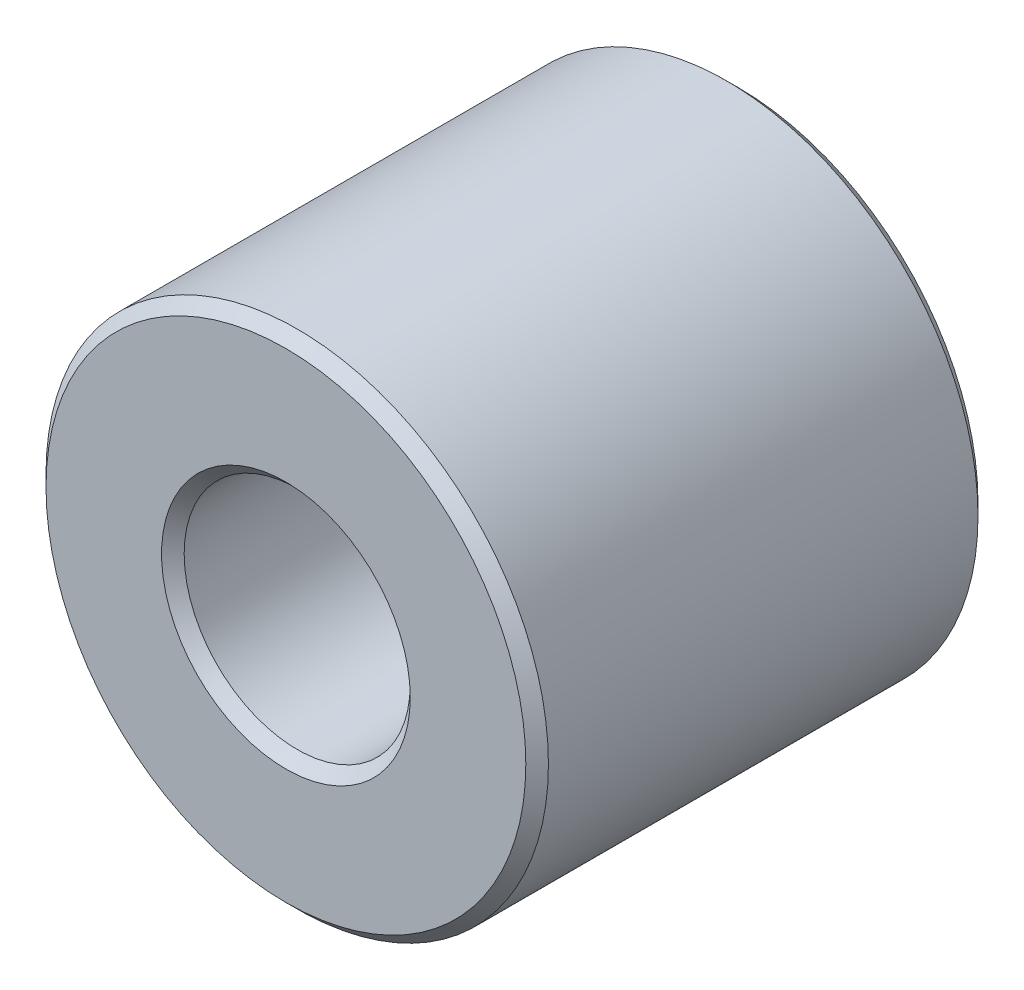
ISO-10303-21;
HEADER;
FILE_DESCRIPTION(('STEP AP214'),'2;1');
FILE_NAME('part.step','',(''),(''),'','','');
FILE_SCHEMA(('AUTOMOTIVE_DESIGN { 1 0 10303 214 1 1 1 1 }'));
ENDSEC;
DATA;
#1=APPLICATION_CONTEXT('core data for automotive mechanical design processes');
#2=APPLICATION_PROTOCOL_DEFINITION('international standard','automotive_design',2000,#1);
#3=PRODUCT_CONTEXT('',#1,'mechanical');
#4=PRODUCT('Part','Part','',(#3));
#5=PRODUCT_RELATED_PRODUCT_CATEGORY('part','',(#4));
#6=PRODUCT_DEFINITION_FORMATION('','',#4);
#7=PRODUCT_DEFINITION_CONTEXT('part definition',#1,'design');
#8=PRODUCT_DEFINITION('design','',#6,#7);
#9=PRODUCT_DEFINITION_SHAPE('','',#8);
#10=(LENGTH_UNIT() NAMED_UNIT(*) SI_UNIT(.MILLI.,.METRE.));
#11=(NAMED_UNIT(*) PLANE_ANGLE_UNIT() SI_UNIT($,.RADIAN.));
#12=(NAMED_UNIT(*) SI_UNIT($,.STERADIAN.) SOLID_ANGLE_UNIT());
#13=UNCERTAINTY_MEASURE_WITH_UNIT(LENGTH_MEASURE(1.E-05),#10,'distance_accuracy_value','');
#14=(GEOMETRIC_REPRESENTATION_CONTEXT(3) GLOBAL_UNCERTAINTY_ASSIGNED_CONTEXT((#13)) GLOBAL_UNIT_ASSIGNED_CONTEXT((#10,
#11,#12)) REPRESENTATION_CONTEXT('',''));
#15=CARTESIAN_POINT('',(0.,0.,0.));
#16=DIRECTION('',(0.,0.,1.));
#17=DIRECTION('',(1.,0.,0.));
#18=AXIS2_PLACEMENT_3D('',#15,#16,#17);
#19=CARTESIAN_POINT('',(0.,0.,18.));
#20=DIRECTION('',(0.,0.,1.));
#21=DIRECTION('',(1.,0.,0.));
#22=AXIS2_PLACEMENT_3D('',#19,#20,#21);
#23=PLANE('',#22);
#24=CARTESIAN_POINT('',(0.,0.,18.));
#25=DIRECTION('',(0.,0.,1.));
#26=DIRECTION('',(1.,0.,0.));
#27=AXIS2_PLACEMENT_3D('',#24,#25,#26);
#28=CIRCLE('',#27,9.90000000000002);
#29=CARTESIAN_POINT('',(9.90000000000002,0.,18.));
#30=VERTEX_POINT('',#29);
#31=EDGE_CURVE('E10',#30,#30,#28,.F.);
#32=ORIENTED_EDGE('',*,*,#31,.T.);
#33=EDGE_LOOP('',(#32));
#34=FACE_BOUND('',#33,.T.);
#35=CARTESIAN_POINT('',(0.,0.,18.));
#36=DIRECTION('',(0.,0.,1.));
#37=DIRECTION('',(1.,0.,0.));
#38=AXIS2_PLACEMENT_3D('',#35,#36,#37);
#39=CIRCLE('',#38,19.1);
#40=CARTESIAN_POINT('',(19.1,0.,18.));
#41=VERTEX_POINT('',#40);
#42=EDGE_CURVE('E45',#41,#41,#39,.T.);
#43=ORIENTED_EDGE('',*,*,#42,.T.);
#44=EDGE_LOOP('',(#43));
#45=FACE_BOUND('',#44,.T.);
#46=ADVANCED_FACE('F37',(#34,#45),#23,.T.);
#47=CARTESIAN_POINT('',(0.,0.,-18.));
#48=DIRECTION('',(0.,0.,1.));
#49=DIRECTION('',(1.,0.,0.));
#50=AXIS2_PLACEMENT_3D('',#47,#48,#49);
#51=PLANE('',#50);
#52=CARTESIAN_POINT('',(0.,0.,-18.));
#53=DIRECTION('',(0.,0.,1.));
#54=DIRECTION('',(1.,0.,0.));
#55=AXIS2_PLACEMENT_3D('',#52,#53,#54);
#56=CIRCLE('',#55,9.9);
#57=CARTESIAN_POINT('',(9.9,0.,-18.));
#58=VERTEX_POINT('',#57);
#59=EDGE_CURVE('E69',#58,#58,#56,.T.);
#60=ORIENTED_EDGE('',*,*,#59,.T.);
#61=EDGE_LOOP('',(#60));
#62=FACE_BOUND('',#61,.T.);
#63=CARTESIAN_POINT('',(0.,0.,-18.));
#64=DIRECTION('',(0.,0.,1.));
#65=DIRECTION('',(1.,0.,0.));
#66=AXIS2_PLACEMENT_3D('',#63,#64,#65);
#67=CIRCLE('',#66,19.1);
#68=CARTESIAN_POINT('',(19.1,0.,-18.));
#69=VERTEX_POINT('',#68);
#70=EDGE_CURVE('E73',#69,#69,#67,.F.);
#71=ORIENTED_EDGE('',*,*,#70,.T.);
#72=EDGE_LOOP('',(#71));
#73=FACE_BOUND('',#72,.T.);
#74=ADVANCED_FACE('F78',(#62,#73),#51,.F.);
#75=CARTESIAN_POINT('',(0.,0.,18.));
#76=DIRECTION('',(0.,0.,-1.));
#77=DIRECTION('',(-1.,0.,0.));
#78=AXIS2_PLACEMENT_3D('',#75,#76,#77);
#79=CYLINDRICAL_SURFACE('',#78,20.);
#80=CARTESIAN_POINT('',(0.,0.,-17.1));
#81=DIRECTION('',(0.,0.,1.));
#82=DIRECTION('',(1.,0.,0.));
#83=AXIS2_PLACEMENT_3D('',#80,#81,#82);
#84=CIRCLE('',#83,20.);
#85=CARTESIAN_POINT('',(20.,0.,-17.1));
#86=VERTEX_POINT('',#85);
#87=EDGE_CURVE('E52',#86,#86,#84,.T.);
#88=ORIENTED_EDGE('',*,*,#87,.T.);
#89=EDGE_LOOP('',(#88));
#90=FACE_BOUND('',#89,.T.);
#91=CARTESIAN_POINT('',(0.,0.,17.1));
#92=DIRECTION('',(0.,0.,1.));
#93=DIRECTION('',(1.,0.,0.));
#94=AXIS2_PLACEMENT_3D('',#91,#92,#93);
#95=CIRCLE('',#94,20.);
#96=CARTESIAN_POINT('',(20.,0.,17.1));
#97=VERTEX_POINT('',#96);
#98=EDGE_CURVE('E57',#97,#97,#95,.F.);
#99=ORIENTED_EDGE('',*,*,#98,.T.);
#100=EDGE_LOOP('',(#99));
#101=FACE_BOUND('',#100,.T.);
#102=ADVANCED_FACE('F88',(#90,#101),#79,.T.);
#103=CARTESIAN_POINT('',(0.,0.,18.));
#104=DIRECTION('',(0.,0.,-1.));
#105=DIRECTION('',(-1.,0.,0.));
#106=AXIS2_PLACEMENT_3D('',#103,#104,#105);
#107=CYLINDRICAL_SURFACE('',#106,9.);
#108=CARTESIAN_POINT('',(0.,0.,-17.1));
#109=DIRECTION('',(0.,0.,1.));
#110=DIRECTION('',(1.,0.,0.));
#111=AXIS2_PLACEMENT_3D('',#108,#109,#110);
#112=CIRCLE('',#111,9.);
#113=CARTESIAN_POINT('',(9.,0.,-17.1));
#114=VERTEX_POINT('',#113);
#115=EDGE_CURVE('E63',#114,#114,#112,.F.);
#116=ORIENTED_EDGE('',*,*,#115,.T.);
#117=EDGE_LOOP('',(#116));
#118=FACE_BOUND('',#117,.T.);
#119=CARTESIAN_POINT('',(0.,0.,17.1));
#120=DIRECTION('',(0.,0.,1.));
#121=DIRECTION('',(1.,0.,0.));
#122=AXIS2_PLACEMENT_3D('',#119,#120,#121);
#123=CIRCLE('',#122,9.);
#124=CARTESIAN_POINT('',(9.,0.,17.1));
#125=VERTEX_POINT('',#124);
#126=EDGE_CURVE('E66',#125,#125,#123,.T.);
#127=ORIENTED_EDGE('',*,*,#126,.T.);
#128=EDGE_LOOP('',(#127));
#129=FACE_BOUND('',#128,.T.);
#130=ADVANCED_FACE('F91',(#118,#129),#107,.F.);
#131=CARTESIAN_POINT('',(0.,0.,-18.));
#132=DIRECTION('',(0.,0.,-1.));
#133=DIRECTION('',(-1.,0.,0.));
#134=AXIS2_PLACEMENT_3D('',#131,#132,#133);
#135=CONICAL_SURFACE('',#134,9.9,0.785398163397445);
#136=ORIENTED_EDGE('',*,*,#115,.F.);
#137=EDGE_LOOP('',(#136));
#138=FACE_BOUND('',#137,.T.);
#139=ORIENTED_EDGE('',*,*,#59,.F.);
#140=EDGE_LOOP('',(#139));
#141=FACE_BOUND('',#140,.T.);
#142=ADVANCED_FACE('F84',(#138,#141),#135,.F.);
#143=CARTESIAN_POINT('',(0.,0.,-17.1));
#144=DIRECTION('',(0.,0.,1.));
#145=DIRECTION('',(1.,0.,0.));
#146=AXIS2_PLACEMENT_3D('',#143,#144,#145);
#147=CONICAL_SURFACE('',#146,20.,0.785398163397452);
#148=CARTESIAN_POINT('',(19.1,0.,-18.));
#149=CARTESIAN_POINT('',(19.109375,0.,-17.990625));
#150=CARTESIAN_POINT('',(19.11875,0.,-17.98125));
#151=CARTESIAN_POINT('',(19.1375,0.,-17.9625));
#152=CARTESIAN_POINT('',(19.146875,0.,-17.953125));
#153=CARTESIAN_POINT('',(19.165625,0.,-17.934375));
#154=CARTESIAN_POINT('',(19.175,0.,-17.925));
#155=CARTESIAN_POINT('',(19.19375,0.,-17.90625));
#156=CARTESIAN_POINT('',(19.203125,0.,-17.896875));
#157=CARTESIAN_POINT('',(19.221875,0.,-17.878125));
#158=CARTESIAN_POINT('',(19.23125,0.,-17.86875));
#159=CARTESIAN_POINT('',(19.25,0.,-17.85));
#160=CARTESIAN_POINT('',(19.259375,0.,-17.840625));
#161=CARTESIAN_POINT('',(19.278125,0.,-17.821875));
#162=CARTESIAN_POINT('',(19.2875,0.,-17.8125));
#163=CARTESIAN_POINT('',(19.30625,0.,-17.79375));
#164=CARTESIAN_POINT('',(19.315625,0.,-17.784375));
#165=CARTESIAN_POINT('',(19.334375,0.,-17.765625));
#166=CARTESIAN_POINT('',(19.34375,0.,-17.75625));
#167=CARTESIAN_POINT('',(19.3625,0.,-17.7375));
#168=CARTESIAN_POINT('',(19.371875,0.,-17.728125));
#169=CARTESIAN_POINT('',(19.390625,0.,-17.709375));
#170=CARTESIAN_POINT('',(19.4,0.,-17.7));
#171=CARTESIAN_POINT('',(19.41875,0.,-17.68125));
#172=CARTESIAN_POINT('',(19.428125,0.,-17.671875));
#173=CARTESIAN_POINT('',(19.446875,0.,-17.653125));
#174=CARTESIAN_POINT('',(19.45625,0.,-17.64375));
#175=CARTESIAN_POINT('',(19.475,0.,-17.625));
#176=CARTESIAN_POINT('',(19.484375,0.,-17.615625));
#177=CARTESIAN_POINT('',(19.503125,0.,-17.596875));
#178=CARTESIAN_POINT('',(19.5125,0.,-17.5875));
#179=CARTESIAN_POINT('',(19.53125,0.,-17.56875));
#180=CARTESIAN_POINT('',(19.540625,0.,-17.559375));
#181=CARTESIAN_POINT('',(19.559375,0.,-17.540625));
#182=CARTESIAN_POINT('',(19.56875,0.,-17.53125));
#183=CARTESIAN_POINT('',(19.5875,0.,-17.5125));
#184=CARTESIAN_POINT('',(19.596875,0.,-17.503125));
#185=CARTESIAN_POINT('',(19.615625,0.,-17.484375));
#186=CARTESIAN_POINT('',(19.625,0.,-17.475));
#187=CARTESIAN_POINT('',(19.64375,0.,-17.45625));
#188=CARTESIAN_POINT('',(19.653125,0.,-17.446875));
#189=CARTESIAN_POINT('',(19.671875,0.,-17.428125));
#190=CARTESIAN_POINT('',(19.68125,0.,-17.41875));
#191=CARTESIAN_POINT('',(19.7,0.,-17.4));
#192=CARTESIAN_POINT('',(19.709375,0.,-17.390625));
#193=CARTESIAN_POINT('',(19.728125,0.,-17.371875));
#194=CARTESIAN_POINT('',(19.7375,0.,-17.3625));
#195=CARTESIAN_POINT('',(19.75625,0.,-17.34375));
#196=CARTESIAN_POINT('',(19.765625,0.,-17.334375));
#197=CARTESIAN_POINT('',(19.784375,0.,-17.315625));
#198=CARTESIAN_POINT('',(19.79375,0.,-17.30625));
#199=CARTESIAN_POINT('',(19.8125,0.,-17.2875));
#200=CARTESIAN_POINT('',(19.821875,0.,-17.278125));
#201=CARTESIAN_POINT('',(19.840625,0.,-17.259375));
#202=CARTESIAN_POINT('',(19.85,0.,-17.25));
#203=CARTESIAN_POINT('',(19.86875,0.,-17.23125));
#204=CARTESIAN_POINT('',(19.878125,0.,-17.221875));
#205=CARTESIAN_POINT('',(19.896875,0.,-17.203125));
#206=CARTESIAN_POINT('',(19.90625,0.,-17.19375));
#207=CARTESIAN_POINT('',(19.925,0.,-17.175));
#208=CARTESIAN_POINT('',(19.934375,0.,-17.165625));
#209=CARTESIAN_POINT('',(19.953125,0.,-17.146875));
#210=CARTESIAN_POINT('',(19.9625,0.,-17.1375));
#211=CARTESIAN_POINT('',(19.98125,0.,-17.11875));
#212=CARTESIAN_POINT('',(19.990625,0.,-17.109375));
#213=CARTESIAN_POINT('',(20.,0.,-17.1));
#214=B_SPLINE_CURVE_WITH_KNOTS('',3,(#148,#149,#150,#151,#152,#153,#154,#155,#156,#157,#158,
#159,#160,#161,#162,#163,#164,#165,#166,#167,#168,#169,#170,#171,#172,#173,#174,#175,#176,#177,
#178,#179,#180,#181,#182,#183,#184,#185,#186,#187,#188,#189,#190,#191,#192,#193,#194,#195,#196,
#197,#198,#199,#200,#201,#202,#203,#204,#205,#206,#207,#208,#209,#210,#211,#212,#213),
.UNSPECIFIED.,.F.,.F.,(4,2,2,2,2,2,2,2,2,2,2,2,2,2,2,2,2,2,2,2,2,2,2,2,2,2,2,2,2,2,2,2,4),(0.,
0.0397747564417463,0.0795495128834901,0.119324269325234,0.159099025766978,0.198873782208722,
0.238648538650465,0.278423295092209,0.318198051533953,0.357972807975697,0.397747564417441,
0.437522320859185,0.477297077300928,0.517071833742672,0.556846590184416,0.59662134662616,
0.636396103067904,0.67617085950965,0.715945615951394,0.755720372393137,0.795495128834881,
0.835269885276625,0.875044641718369,0.914819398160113,0.954594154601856,0.9943689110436,
1.03414366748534,1.07391842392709,1.11369318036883,1.15346793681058,1.19324269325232,
1.23301744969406,1.27279220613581),.UNSPECIFIED.);
#215=EDGE_CURVE('BSEAM80',#69,#86,#214,.T.);
#216=ORIENTED_EDGE('',*,*,#70,.F.);
#217=ORIENTED_EDGE('',*,*,#87,.F.);
#218=ORIENTED_EDGE('',*,*,#215,.T.);
#219=ORIENTED_EDGE('',*,*,#215,.F.);
#220=EDGE_LOOP('',(#216,#218,#217,#219));
#221=FACE_BOUND('',#220,.T.);
#222=ADVANCED_FACE('F80',(#221),#147,.T.);
#223=CARTESIAN_POINT('',(0.,0.,17.1));
#224=DIRECTION('',(0.,0.,1.));
#225=DIRECTION('',(1.,0.,0.));
#226=AXIS2_PLACEMENT_3D('',#223,#224,#225);
#227=CONICAL_SURFACE('',#226,9.,0.785398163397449);
#228=ORIENTED_EDGE('',*,*,#31,.F.);
#229=EDGE_LOOP('',(#228));
#230=FACE_BOUND('',#229,.T.);
#231=ORIENTED_EDGE('',*,*,#126,.F.);
#232=EDGE_LOOP('',(#231));
#233=FACE_BOUND('',#232,.T.);
#234=ADVANCED_FACE('F83',(#230,#233),#227,.F.);
#235=CARTESIAN_POINT('',(0.,0.,18.));
#236=DIRECTION('',(0.,0.,-1.));
#237=DIRECTION('',(-1.,0.,0.));
#238=AXIS2_PLACEMENT_3D('',#235,#236,#237);
#239=CONICAL_SURFACE('',#238,19.1,0.785398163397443);
#240=ORIENTED_EDGE('',*,*,#98,.F.);
#241=EDGE_LOOP('',(#240));
#242=FACE_BOUND('',#241,.T.);
#243=ORIENTED_EDGE('',*,*,#42,.F.);
#244=EDGE_LOOP('',(#243));
#245=FACE_BOUND('',#244,.T.);
#246=ADVANCED_FACE('F39',(#242,#245),#239,.T.);
#247=CLOSED_SHELL('',(#46,#74,#102,#130,#142,#222,#234,#246));
#248=MANIFOLD_SOLID_BREP('B2',#247);
#249=ADVANCED_BREP_SHAPE_REPRESENTATION('',(#18,#248),#14);
#250=SHAPE_DEFINITION_REPRESENTATION(#9,#249);
ENDSEC;
END-ISO-10303-21;
